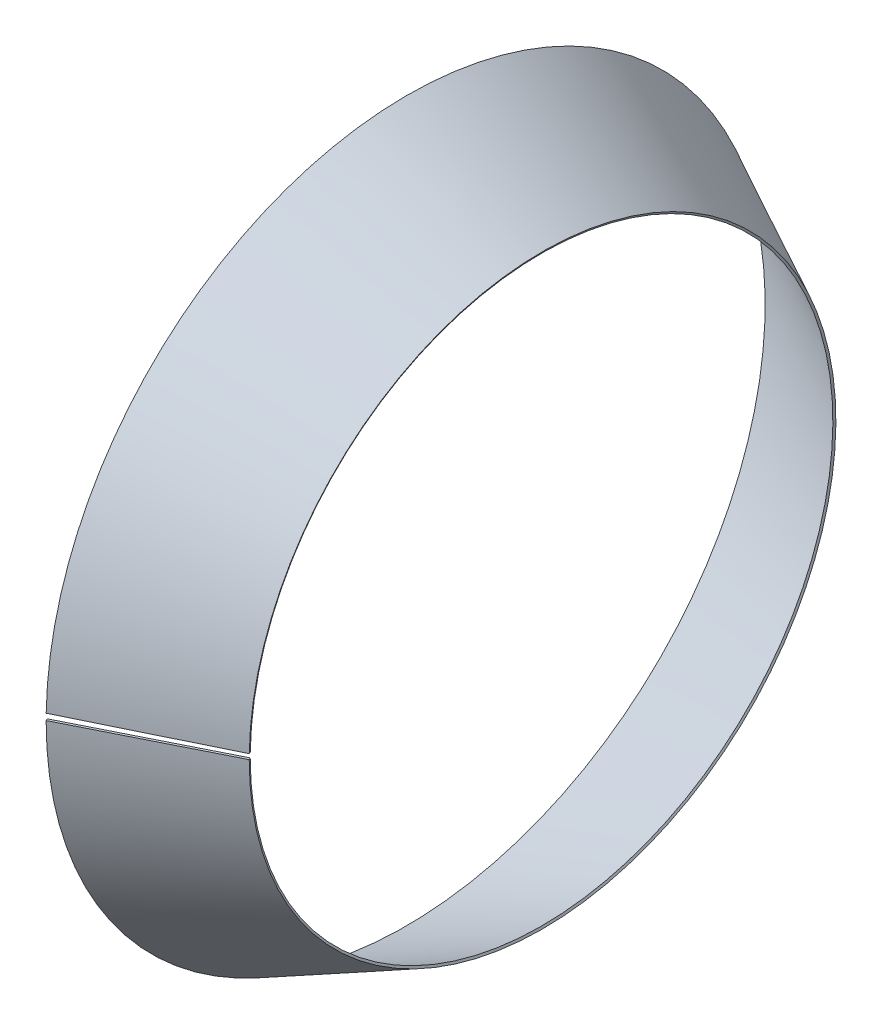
ISO-10303-21;
HEADER;
FILE_DESCRIPTION(('STEP AP214'),'2;1');
FILE_NAME('part.step','',(''),(''),'','','');
FILE_SCHEMA(('AUTOMOTIVE_DESIGN { 1 0 10303 214 1 1 1 1 }'));
ENDSEC;
DATA;
#1=APPLICATION_CONTEXT('core data for automotive mechanical design processes');
#2=APPLICATION_PROTOCOL_DEFINITION('international standard','automotive_design',2000,#1);
#3=PRODUCT_CONTEXT('',#1,'mechanical');
#4=PRODUCT('Part','Part','',(#3));
#5=PRODUCT_RELATED_PRODUCT_CATEGORY('part','',(#4));
#6=PRODUCT_DEFINITION_FORMATION('','',#4);
#7=PRODUCT_DEFINITION_CONTEXT('part definition',#1,'design');
#8=PRODUCT_DEFINITION('design','',#6,#7);
#9=PRODUCT_DEFINITION_SHAPE('','',#8);
#10=(LENGTH_UNIT() NAMED_UNIT(*) SI_UNIT(.MILLI.,.METRE.));
#11=(NAMED_UNIT(*) PLANE_ANGLE_UNIT() SI_UNIT($,.RADIAN.));
#12=(NAMED_UNIT(*) SI_UNIT($,.STERADIAN.) SOLID_ANGLE_UNIT());
#13=UNCERTAINTY_MEASURE_WITH_UNIT(LENGTH_MEASURE(1.E-05),#10,'distance_accuracy_value','');
#14=(GEOMETRIC_REPRESENTATION_CONTEXT(3) GLOBAL_UNCERTAINTY_ASSIGNED_CONTEXT((#13)) GLOBAL_UNIT_ASSIGNED_CONTEXT((#10,
#11,#12)) REPRESENTATION_CONTEXT('',''));
#15=CARTESIAN_POINT('',(0.,0.,0.));
#16=DIRECTION('',(0.,0.,1.));
#17=DIRECTION('',(1.,0.,0.));
#18=AXIS2_PLACEMENT_3D('',#15,#16,#17);
#19=CARTESIAN_POINT('',(60.,2.26881283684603,129.980200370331));
#20=DIRECTION('',(0.,0.999847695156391,-0.017452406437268));
#21=DIRECTION('',(-0.894427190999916,0.00780495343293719,0.447145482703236));
#22=AXIS2_PLACEMENT_3D('',#19,#20,#21);
#23=PLANE('',#22);
#24=DIRECTION('',(-0.447213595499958,-0.0156099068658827,-0.894290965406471));
#25=VECTOR('',#24,1.);
#26=CARTESIAN_POINT('',(60.,2.26881283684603,129.980200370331));
#27=LINE('',#26,#25);
#28=CARTESIAN_POINT('',(60.,2.26881283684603,129.980200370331));
#29=VERTEX_POINT('',#28);
#30=CARTESIAN_POINT('',(59.5527864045,2.25320292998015,129.085909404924));
#31=VERTEX_POINT('',#30);
#32=EDGE_CURVE('E12',#29,#31,#27,.T.);
#33=ORIENTED_EDGE('',*,*,#32,.F.);
#34=DIRECTION('',(-0.894427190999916,0.00780495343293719,0.447145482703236));
#35=VECTOR('',#34,1.);
#36=CARTESIAN_POINT('',(60.,2.26881283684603,129.980200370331));
#37=LINE('',#36,#35);
#38=CARTESIAN_POINT('',(0.,2.79238502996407,159.975631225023));
#39=VERTEX_POINT('',#38);
#40=EDGE_CURVE('E101',#29,#39,#37,.T.);
#41=ORIENTED_EDGE('',*,*,#40,.T.);
#42=DIRECTION('',(-0.447213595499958,-0.0156099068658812,-0.894290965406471));
#43=VECTOR('',#42,1.);
#44=CARTESIAN_POINT('',(0.,2.79238502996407,159.975631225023));
#45=LINE('',#44,#43);
#46=CARTESIAN_POINT('',(-0.44721359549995,2.77677512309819,159.081340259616));
#47=VERTEX_POINT('',#46);
#48=EDGE_CURVE('E51',#39,#47,#45,.T.);
#49=ORIENTED_EDGE('',*,*,#48,.T.);
#50=DIRECTION('',(-0.894427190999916,0.00780495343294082,0.447145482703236));
#51=VECTOR('',#50,1.);
#52=CARTESIAN_POINT('',(59.5527864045,2.25320292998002,129.085909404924));
#53=LINE('',#52,#51);
#54=EDGE_CURVE('E110',#31,#47,#53,.T.);
#55=ORIENTED_EDGE('',*,*,#54,.F.);
#56=EDGE_LOOP('',(#33,#41,#49,#55));
#57=FACE_BOUND('',#56,.T.);
#58=ADVANCED_FACE('F41',(#57),#23,.F.);
#59=CARTESIAN_POINT('',(0.,0.,0.));
#60=DIRECTION('',(1.,0.,0.));
#61=DIRECTION('',(0.,1.,0.));
#62=AXIS2_PLACEMENT_3D('',#59,#60,#61);
#63=CONICAL_SURFACE('',#62,160.,1.10714871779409);
#64=ORIENTED_EDGE('',*,*,#48,.F.);
#65=CARTESIAN_POINT('',(0.,0.,0.));
#66=DIRECTION('',(-1.,0.,0.));
#67=DIRECTION('',(0.,-1.,0.));
#68=AXIS2_PLACEMENT_3D('',#65,#66,#67);
#69=CIRCLE('',#68,160.);
#70=CARTESIAN_POINT('',(0.,-1.61762964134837E-13,160.));
#71=VERTEX_POINT('',#70);
#72=EDGE_CURVE('E97',#39,#71,#69,.T.);
#73=ORIENTED_EDGE('',*,*,#72,.T.);
#74=DIRECTION('',(-0.447213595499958,0.,-0.894427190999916));
#75=VECTOR('',#74,1.);
#76=CARTESIAN_POINT('',(0.,-1.61762964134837E-13,160.));
#77=LINE('',#76,#75);
#78=CARTESIAN_POINT('',(-0.447213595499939,-1.60886064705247E-13,159.105572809));
#79=VERTEX_POINT('',#78);
#80=EDGE_CURVE('E82',#71,#79,#77,.T.);
#81=ORIENTED_EDGE('',*,*,#80,.T.);
#82=CARTESIAN_POINT('',(-0.44721359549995,0.,0.));
#83=DIRECTION('',(-1.,0.,0.));
#84=DIRECTION('',(0.,-1.,0.));
#85=AXIS2_PLACEMENT_3D('',#82,#83,#84);
#86=CIRCLE('',#85,159.105572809);
#87=EDGE_CURVE('E112',#47,#79,#86,.T.);
#88=ORIENTED_EDGE('',*,*,#87,.F.);
#89=EDGE_LOOP('',(#64,#73,#81,#88));
#90=FACE_BOUND('',#89,.T.);
#91=ADVANCED_FACE('F100',(#90),#63,.T.);
#92=CARTESIAN_POINT('',(60.,0.,130.));
#93=DIRECTION('',(0.,1.,0.));
#94=DIRECTION('',(-0.894427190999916,0.,0.447213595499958));
#95=AXIS2_PLACEMENT_3D('',#92,#93,#94);
#96=PLANE('',#95);
#97=ORIENTED_EDGE('',*,*,#80,.F.);
#98=DIRECTION('',(-0.894427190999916,0.,0.447213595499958));
#99=VECTOR('',#98,1.);
#100=CARTESIAN_POINT('',(60.,0.,130.));
#101=LINE('',#100,#99);
#102=CARTESIAN_POINT('',(60.,0.,130.));
#103=VERTEX_POINT('',#102);
#104=EDGE_CURVE('E85',#103,#71,#101,.T.);
#105=ORIENTED_EDGE('',*,*,#104,.F.);
#106=DIRECTION('',(-0.447213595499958,0.,-0.894427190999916));
#107=VECTOR('',#106,1.);
#108=CARTESIAN_POINT('',(60.,0.,130.));
#109=LINE('',#108,#107);
#110=CARTESIAN_POINT('',(59.5527864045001,0.,129.105572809));
#111=VERTEX_POINT('',#110);
#112=EDGE_CURVE('E45',#103,#111,#109,.T.);
#113=ORIENTED_EDGE('',*,*,#112,.T.);
#114=DIRECTION('',(-0.894427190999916,0.,0.447213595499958));
#115=VECTOR('',#114,1.);
#116=CARTESIAN_POINT('',(59.5527864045,0.,129.105572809));
#117=LINE('',#116,#115);
#118=EDGE_CURVE('E87',#111,#79,#117,.T.);
#119=ORIENTED_EDGE('',*,*,#118,.T.);
#120=EDGE_LOOP('',(#97,#105,#113,#119));
#121=FACE_BOUND('',#120,.T.);
#122=ADVANCED_FACE('F84',(#121),#96,.T.);
#123=CARTESIAN_POINT('',(60.,0.,0.));
#124=DIRECTION('',(1.,0.,0.));
#125=DIRECTION('',(0.,1.,0.));
#126=AXIS2_PLACEMENT_3D('',#123,#124,#125);
#127=CONICAL_SURFACE('',#126,130.,1.10714871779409);
#128=CARTESIAN_POINT('',(60.,0.,0.));
#129=DIRECTION('',(-1.,0.,0.));
#130=DIRECTION('',(0.,-1.,0.));
#131=AXIS2_PLACEMENT_3D('',#128,#129,#130);
#132=CIRCLE('',#131,130.);
#133=EDGE_CURVE('E98',#29,#103,#132,.T.);
#134=ORIENTED_EDGE('',*,*,#133,.F.);
#135=ORIENTED_EDGE('',*,*,#32,.T.);
#136=CARTESIAN_POINT('',(59.5527864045,0.,0.));
#137=DIRECTION('',(-1.,0.,0.));
#138=DIRECTION('',(0.,-1.,0.));
#139=AXIS2_PLACEMENT_3D('',#136,#137,#138);
#140=CIRCLE('',#139,129.105572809);
#141=EDGE_CURVE('E103',#31,#111,#140,.T.);
#142=ORIENTED_EDGE('',*,*,#141,.T.);
#143=ORIENTED_EDGE('',*,*,#112,.F.);
#144=EDGE_LOOP('',(#134,#135,#142,#143));
#145=FACE_BOUND('',#144,.T.);
#146=ADVANCED_FACE('F43',(#145),#127,.F.);
#147=CARTESIAN_POINT('',(59.5527864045,0.,0.));
#148=DIRECTION('',(-1.,0.,0.));
#149=DIRECTION('',(0.,-1.,0.));
#150=AXIS2_PLACEMENT_3D('',#147,#148,#149);
#151=CONICAL_SURFACE('',#150,129.105572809,0.463647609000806);
#152=ORIENTED_EDGE('',*,*,#118,.F.);
#153=ORIENTED_EDGE('',*,*,#141,.F.);
#154=ORIENTED_EDGE('',*,*,#54,.T.);
#155=ORIENTED_EDGE('',*,*,#87,.T.);
#156=EDGE_LOOP('',(#152,#153,#154,#155));
#157=FACE_BOUND('',#156,.T.);
#158=ADVANCED_FACE('F115',(#157),#151,.F.);
#159=CARTESIAN_POINT('',(60.,0.,0.));
#160=DIRECTION('',(-1.,0.,0.));
#161=DIRECTION('',(0.,-1.,0.));
#162=AXIS2_PLACEMENT_3D('',#159,#160,#161);
#163=CONICAL_SURFACE('',#162,130.,0.463647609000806);
#164=ORIENTED_EDGE('',*,*,#104,.T.);
#165=ORIENTED_EDGE('',*,*,#72,.F.);
#166=ORIENTED_EDGE('',*,*,#40,.F.);
#167=ORIENTED_EDGE('',*,*,#133,.T.);
#168=EDGE_LOOP('',(#164,#165,#166,#167));
#169=FACE_BOUND('',#168,.T.);
#170=ADVANCED_FACE('F95',(#169),#163,.T.);
#171=CLOSED_SHELL('',(#58,#91,#122,#146,#158,#170));
#172=MANIFOLD_SOLID_BREP('B2',#171);
#173=ADVANCED_BREP_SHAPE_REPRESENTATION('',(#18,#172),#14);
#174=SHAPE_DEFINITION_REPRESENTATION(#9,#173);
ENDSEC;
END-ISO-10303-21;
